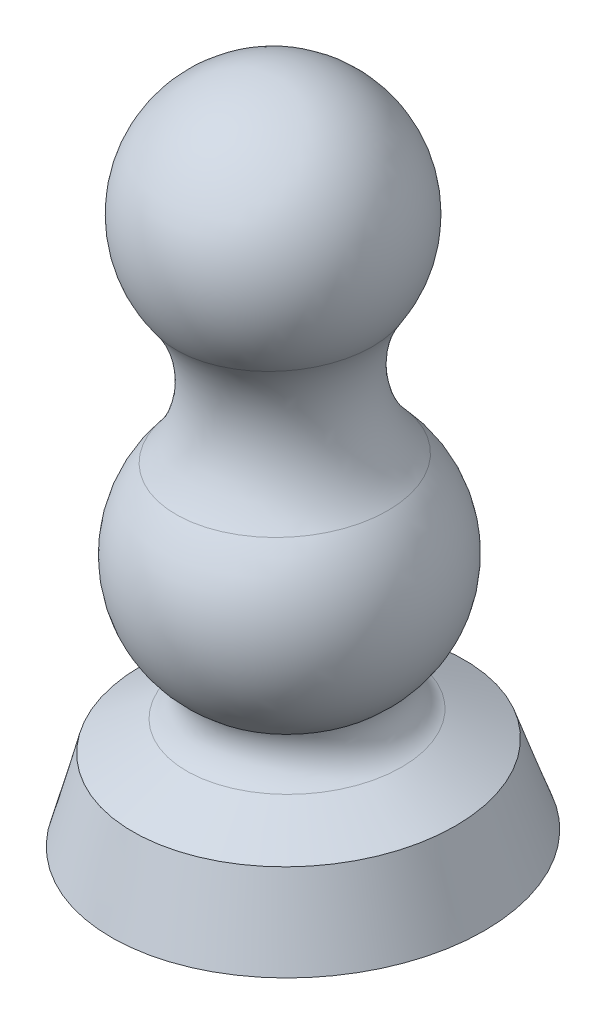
ISO-10303-21;
HEADER;
FILE_DESCRIPTION(('STEP AP214'),'2;1');
FILE_NAME('part.step','',(''),(''),'','','');
FILE_SCHEMA(('AUTOMOTIVE_DESIGN { 1 0 10303 214 1 1 1 1 }'));
ENDSEC;
DATA;
#1=APPLICATION_CONTEXT('core data for automotive mechanical design processes');
#2=APPLICATION_PROTOCOL_DEFINITION('international standard','automotive_design',2000,#1);
#3=PRODUCT_CONTEXT('',#1,'mechanical');
#4=PRODUCT('Part','Part','',(#3));
#5=PRODUCT_RELATED_PRODUCT_CATEGORY('part','',(#4));
#6=PRODUCT_DEFINITION_FORMATION('','',#4);
#7=PRODUCT_DEFINITION_CONTEXT('part definition',#1,'design');
#8=PRODUCT_DEFINITION('design','',#6,#7);
#9=PRODUCT_DEFINITION_SHAPE('','',#8);
#10=(LENGTH_UNIT() NAMED_UNIT(*) SI_UNIT(.MILLI.,.METRE.));
#11=(NAMED_UNIT(*) PLANE_ANGLE_UNIT() SI_UNIT($,.RADIAN.));
#12=(NAMED_UNIT(*) SI_UNIT($,.STERADIAN.) SOLID_ANGLE_UNIT());
#13=UNCERTAINTY_MEASURE_WITH_UNIT(LENGTH_MEASURE(1.E-05),#10,'distance_accuracy_value','');
#14=(GEOMETRIC_REPRESENTATION_CONTEXT(3) GLOBAL_UNCERTAINTY_ASSIGNED_CONTEXT((#13)) GLOBAL_UNIT_ASSIGNED_CONTEXT((#10,
#11,#12)) REPRESENTATION_CONTEXT('',''));
#15=CARTESIAN_POINT('',(0.,0.,0.));
#16=DIRECTION('',(0.,0.,1.));
#17=DIRECTION('',(1.,0.,0.));
#18=AXIS2_PLACEMENT_3D('',#15,#16,#17);
#19=CARTESIAN_POINT('',(-0.175417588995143,3.08008552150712,0.));
#20=DIRECTION('',(-0.0568600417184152,0.998382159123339,0.));
#21=DIRECTION('',(-0.998382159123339,-0.0568600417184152,0.));
#22=AXIS2_PLACEMENT_3D('',#19,#20,#21);
#23=CONICAL_SURFACE('',#22,54.169596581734,1.51390560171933);
#24=CARTESIAN_POINT('',(0.,0.,0.));
#25=VERTEX_POINT('',#24);
#26=VERTEX_LOOP('',#25);
#27=FACE_BOUND('',#26,.T.);
#28=CARTESIAN_POINT('',(-0.175417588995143,3.08008552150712,0.));
#29=DIRECTION('',(0.0568600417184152,-0.998382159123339,0.));
#30=DIRECTION('',(0.998382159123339,0.0568600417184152,0.));
#31=AXIS2_PLACEMENT_3D('',#28,#29,#30);
#32=CIRCLE('',#31,54.169596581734);
#33=CARTESIAN_POINT('',(53.9065412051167,6.16017104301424,0.));
#34=VERTEX_POINT('',#33);
#35=EDGE_CURVE('E11',#34,#34,#32,.T.);
#36=ORIENTED_EDGE('',*,*,#35,.T.);
#37=EDGE_LOOP('',(#36));
#38=FACE_BOUND('',#37,.T.);
#39=ADVANCED_FACE('F32',(#27,#38),#23,.T.);
#40=CARTESIAN_POINT('',(-1.49263490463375,26.2085642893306,0.));
#41=DIRECTION('',(0.0568600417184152,-0.998382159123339,0.));
#42=DIRECTION('',(0.998382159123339,0.0568600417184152,0.));
#43=AXIS2_PLACEMENT_3D('',#40,#41,#42);
#44=CONICAL_SURFACE('',#43,46.8266434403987,0.306953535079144);
#45=ORIENTED_EDGE('',*,*,#35,.F.);
#46=EDGE_LOOP('',(#45));
#47=FACE_BOUND('',#46,.T.);
#48=CARTESIAN_POINT('',(-1.49263490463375,26.2085642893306,0.));
#49=DIRECTION('',(0.0568600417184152,-0.998382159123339,0.));
#50=DIRECTION('',(0.998382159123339,0.0568600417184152,0.));
#51=AXIS2_PLACEMENT_3D('',#48,#49,#50);
#52=CIRCLE('',#51,46.8266434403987);
#53=CARTESIAN_POINT('',(45.2582504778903,28.871129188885,0.));
#54=VERTEX_POINT('',#53);
#55=EDGE_CURVE('E38',#54,#54,#52,.T.);
#56=ORIENTED_EDGE('',*,*,#55,.T.);
#57=EDGE_LOOP('',(#56));
#58=FACE_BOUND('',#57,.T.);
#59=ADVANCED_FACE('F43',(#47,#58),#44,.T.);
#60=CARTESIAN_POINT('',(-1.95232358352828,34.2800493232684,0.));
#61=DIRECTION('',(0.0568600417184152,-0.998382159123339,0.));
#62=DIRECTION('',(0.998382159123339,0.0568600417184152,0.));
#63=AXIS2_PLACEMENT_3D('',#60,#61,#62);
#64=CONICAL_SURFACE('',#63,31.2385002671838,1.09235169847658);
#65=ORIENTED_EDGE('',*,*,#55,.F.);
#66=EDGE_LOOP('',(#65));
#67=FACE_BOUND('',#66,.T.);
#68=CARTESIAN_POINT('',(-1.95232358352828,34.2800493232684,0.));
#69=DIRECTION('',(0.0568600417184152,-0.998382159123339,0.));
#70=DIRECTION('',(0.998382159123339,0.0568600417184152,0.));
#71=AXIS2_PLACEMENT_3D('',#68,#69,#70);
#72=CIRCLE('',#71,31.2385002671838);
#73=CARTESIAN_POINT('',(29.2356377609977,36.0562717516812,0.));
#74=VERTEX_POINT('',#73);
#75=EDGE_CURVE('E52',#74,#74,#72,.T.);
#76=ORIENTED_EDGE('',*,*,#75,.T.);
#77=EDGE_LOOP('',(#76));
#78=FACE_BOUND('',#77,.T.);
#79=ADVANCED_FACE('F48',(#67,#78),#64,.T.);
#80=CARTESIAN_POINT('',(-2.45987043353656,43.1918563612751,0.));
#81=DIRECTION('',(0.0568600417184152,-0.998382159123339,0.));
#82=DIRECTION('',(0.998382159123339,0.0568600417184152,0.));
#83=AXIS2_PLACEMENT_3D('',#80,#81,#82);
#84=TOROIDAL_SURFACE('',#83,35.8679695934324,10.0553416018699);
#85=ORIENTED_EDGE('',*,*,#75,.F.);
#86=EDGE_LOOP('',(#85));
#87=FACE_BOUND('',#86,.T.);
#88=CARTESIAN_POINT('',(-2.62573813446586,46.1042593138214,0.));
#89=DIRECTION('',(0.0568600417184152,-0.998382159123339,0.));
#90=DIRECTION('',(0.998382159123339,0.0568600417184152,0.));
#91=AXIS2_PLACEMENT_3D('',#88,#89,#90);
#92=CIRCLE('',#91,26.2450650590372);
#93=CARTESIAN_POINT('',(23.5768665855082,47.5965548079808,0.));
#94=VERTEX_POINT('',#93);
#95=EDGE_CURVE('E54',#94,#94,#92,.T.);
#96=ORIENTED_EDGE('',*,*,#95,.T.);
#97=EDGE_LOOP('',(#96));
#98=FACE_BOUND('',#97,.T.);
#99=ADVANCED_FACE('F80',(#87,#98),#84,.F.);
#100=CARTESIAN_POINT('',(-4.23164155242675,74.3016589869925,0.));
#101=DIRECTION('',(0.0568600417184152,-0.998382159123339,0.));
#102=DIRECTION('',(0.998382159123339,0.0568600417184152,0.));
#103=AXIS2_PLACEMENT_3D('',#100,#101,#102);
#104=DEGENERATE_TOROIDAL_SURFACE('',#103,4.8712713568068,35.4190814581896,.T.);
#105=ORIENTED_EDGE('',*,*,#95,.F.);
#106=EDGE_LOOP('',(#105));
#107=FACE_BOUND('',#106,.T.);
#108=CARTESIAN_POINT('',(-5.60692199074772,98.4496443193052,0.));
#109=DIRECTION('',(0.0568600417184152,-0.998382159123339,0.));
#110=DIRECTION('',(0.998382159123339,0.0568600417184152,0.));
#111=AXIS2_PLACEMENT_3D('',#108,#109,#110);
#112=CIRCLE('',#111,30.7458677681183);
#113=CARTESIAN_POINT('',(25.0892038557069,100.197855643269,0.));
#114=VERTEX_POINT('',#113);
#115=EDGE_CURVE('E59',#114,#114,#112,.T.);
#116=ORIENTED_EDGE('',*,*,#115,.T.);
#117=EDGE_LOOP('',(#116));
#118=FACE_BOUND('',#117,.T.);
#119=ADVANCED_FACE('F74',(#107,#118),#104,.T.);
#120=CARTESIAN_POINT('',(-6.82950019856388,119.916393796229,0.));
#121=DIRECTION('',(0.0568600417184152,-0.998382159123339,0.));
#122=DIRECTION('',(0.998382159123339,0.0568600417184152,0.));
#123=AXIS2_PLACEMENT_3D('',#120,#121,#122);
#124=TOROIDAL_SURFACE('',#123,53.7475166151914,31.4863761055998);
#125=ORIENTED_EDGE('',*,*,#115,.F.);
#126=EDGE_LOOP('',(#125));
#127=FACE_BOUND('',#126,.T.);
#128=CARTESIAN_POINT('',(-7.89568206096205,138.637043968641,0.));
#129=DIRECTION('',(0.0568600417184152,-0.998382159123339,0.));
#130=DIRECTION('',(0.998382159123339,0.0568600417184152,0.));
#131=AXIS2_PLACEMENT_3D('',#128,#129,#130);
#132=CIRCLE('',#131,28.4533988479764);
#133=CARTESIAN_POINT('',(20.5116837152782,140.254905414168,0.));
#134=VERTEX_POINT('',#133);
#135=EDGE_CURVE('E62',#134,#134,#132,.T.);
#136=ORIENTED_EDGE('',*,*,#135,.T.);
#137=EDGE_LOOP('',(#136));
#138=FACE_BOUND('',#137,.T.);
#139=ADVANCED_FACE('F66',(#127,#138),#124,.F.);
#140=CARTESIAN_POINT('',(-9.0950319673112,159.695937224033,0.));
#141=DIRECTION('',(0.0568600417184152,-0.998382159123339,0.));
#142=DIRECTION('',(0.998382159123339,0.0568600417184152,0.));
#143=AXIS2_PLACEMENT_3D('',#140,#141,#142);
#144=SPHERICAL_SURFACE('',#143,35.4190814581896);
#145=ORIENTED_EDGE('',*,*,#135,.F.);
#146=EDGE_LOOP('',(#145));
#147=FACE_BOUND('',#146,.T.);
#148=ADVANCED_FACE('F68',(#147),#144,.T.);
#149=CLOSED_SHELL('',(#39,#59,#79,#99,#119,#139,#148));
#150=MANIFOLD_SOLID_BREP('B2',#149);
#151=ADVANCED_BREP_SHAPE_REPRESENTATION('',(#18,#150),#14);
#152=SHAPE_DEFINITION_REPRESENTATION(#9,#151);
ENDSEC;
END-ISO-10303-21;
